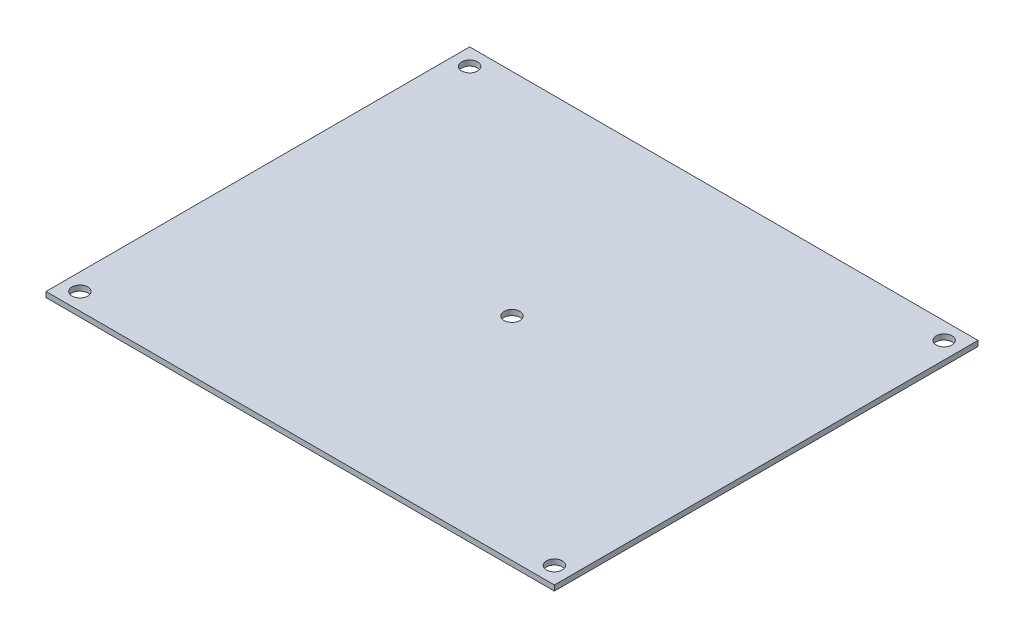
ISO-10303-21;
HEADER;
FILE_DESCRIPTION(('STEP AP214'),'2;1');
FILE_NAME('part.step','',(''),(''),'','','');
FILE_SCHEMA(('AUTOMOTIVE_DESIGN { 1 0 10303 214 1 1 1 1 }'));
ENDSEC;
DATA;
#1=APPLICATION_CONTEXT('core data for automotive mechanical design processes');
#2=APPLICATION_PROTOCOL_DEFINITION('international standard','automotive_design',2000,#1);
#3=PRODUCT_CONTEXT('',#1,'mechanical');
#4=PRODUCT('Part','Part','',(#3));
#5=PRODUCT_RELATED_PRODUCT_CATEGORY('part','',(#4));
#6=PRODUCT_DEFINITION_FORMATION('','',#4);
#7=PRODUCT_DEFINITION_CONTEXT('part definition',#1,'design');
#8=PRODUCT_DEFINITION('design','',#6,#7);
#9=PRODUCT_DEFINITION_SHAPE('','',#8);
#10=(LENGTH_UNIT() NAMED_UNIT(*) SI_UNIT(.MILLI.,.METRE.));
#11=(NAMED_UNIT(*) PLANE_ANGLE_UNIT() SI_UNIT($,.RADIAN.));
#12=(NAMED_UNIT(*) SI_UNIT($,.STERADIAN.) SOLID_ANGLE_UNIT());
#13=UNCERTAINTY_MEASURE_WITH_UNIT(LENGTH_MEASURE(1.E-05),#10,'distance_accuracy_value','');
#14=(GEOMETRIC_REPRESENTATION_CONTEXT(3) GLOBAL_UNCERTAINTY_ASSIGNED_CONTEXT((#13)) GLOBAL_UNIT_ASSIGNED_CONTEXT((#10,
#11,#12)) REPRESENTATION_CONTEXT('',''));
#15=CARTESIAN_POINT('',(0.,0.,0.));
#16=DIRECTION('',(0.,0.,1.));
#17=DIRECTION('',(1.,0.,0.));
#18=AXIS2_PLACEMENT_3D('',#15,#16,#17);
#19=CARTESIAN_POINT('',(-76.2,1.6002,-63.5));
#20=DIRECTION('',(1.,0.,0.));
#21=DIRECTION('',(0.,0.,-1.));
#22=AXIS2_PLACEMENT_3D('',#19,#20,#21);
#23=PLANE('',#22);
#24=DIRECTION('',(0.,0.,1.));
#25=VECTOR('',#24,1.);
#26=CARTESIAN_POINT('',(-76.2,0.,-63.5));
#27=LINE('',#26,#25);
#28=CARTESIAN_POINT('',(-76.2,0.,-63.5));
#29=VERTEX_POINT('',#28);
#30=CARTESIAN_POINT('',(-76.2,0.,63.5));
#31=VERTEX_POINT('',#30);
#32=EDGE_CURVE('E93',#29,#31,#27,.T.);
#33=ORIENTED_EDGE('',*,*,#32,.T.);
#34=DIRECTION('',(0.,-1.,0.));
#35=VECTOR('',#34,1.);
#36=CARTESIAN_POINT('',(-76.2,1.6002,63.5));
#37=LINE('',#36,#35);
#38=CARTESIAN_POINT('',(-76.2,1.6002,63.5));
#39=VERTEX_POINT('',#38);
#40=EDGE_CURVE('E11',#39,#31,#37,.T.);
#41=ORIENTED_EDGE('',*,*,#40,.F.);
#42=DIRECTION('',(0.,0.,1.));
#43=VECTOR('',#42,1.);
#44=CARTESIAN_POINT('',(-76.2,1.6002,-63.5));
#45=LINE('',#44,#43);
#46=CARTESIAN_POINT('',(-76.2,1.6002,-63.5));
#47=VERTEX_POINT('',#46);
#48=EDGE_CURVE('E81',#47,#39,#45,.T.);
#49=ORIENTED_EDGE('',*,*,#48,.F.);
#50=DIRECTION('',(0.,-1.,0.));
#51=VECTOR('',#50,1.);
#52=CARTESIAN_POINT('',(-76.2,1.6002,-63.5));
#53=LINE('',#52,#51);
#54=EDGE_CURVE('E89',#47,#29,#53,.T.);
#55=ORIENTED_EDGE('',*,*,#54,.T.);
#56=EDGE_LOOP('',(#33,#41,#49,#55));
#57=FACE_BOUND('',#56,.T.);
#58=ADVANCED_FACE('F30',(#57),#23,.F.);
#59=CARTESIAN_POINT('',(-76.2,1.6002,63.5));
#60=DIRECTION('',(0.,0.,-1.));
#61=DIRECTION('',(-1.,0.,0.));
#62=AXIS2_PLACEMENT_3D('',#59,#60,#61);
#63=PLANE('',#62);
#64=DIRECTION('',(1.,0.,0.));
#65=VECTOR('',#64,1.);
#66=CARTESIAN_POINT('',(-76.2,0.,63.5));
#67=LINE('',#66,#65);
#68=CARTESIAN_POINT('',(76.2,0.,63.5));
#69=VERTEX_POINT('',#68);
#70=EDGE_CURVE('E85',#31,#69,#67,.T.);
#71=ORIENTED_EDGE('',*,*,#70,.T.);
#72=DIRECTION('',(0.,-1.,0.));
#73=VECTOR('',#72,1.);
#74=CARTESIAN_POINT('',(76.2,1.6002,63.5));
#75=LINE('',#74,#73);
#76=CARTESIAN_POINT('',(76.2,1.6002,63.5));
#77=VERTEX_POINT('',#76);
#78=EDGE_CURVE('E38',#77,#69,#75,.T.);
#79=ORIENTED_EDGE('',*,*,#78,.F.);
#80=DIRECTION('',(1.,0.,0.));
#81=VECTOR('',#80,1.);
#82=CARTESIAN_POINT('',(-76.2,1.6002,63.5));
#83=LINE('',#82,#81);
#84=EDGE_CURVE('E76',#39,#77,#83,.T.);
#85=ORIENTED_EDGE('',*,*,#84,.F.);
#86=ORIENTED_EDGE('',*,*,#40,.T.);
#87=EDGE_LOOP('',(#71,#79,#85,#86));
#88=FACE_BOUND('',#87,.T.);
#89=ADVANCED_FACE('F84',(#88),#63,.F.);
#90=CARTESIAN_POINT('',(76.2,1.6002,-63.5));
#91=DIRECTION('',(-1.,0.,0.));
#92=DIRECTION('',(0.,0.,1.));
#93=AXIS2_PLACEMENT_3D('',#90,#91,#92);
#94=PLANE('',#93);
#95=DIRECTION('',(0.,0.,-1.));
#96=VECTOR('',#95,1.);
#97=CARTESIAN_POINT('',(76.2,0.,-63.5));
#98=LINE('',#97,#96);
#99=CARTESIAN_POINT('',(76.2,0.,-63.5));
#100=VERTEX_POINT('',#99);
#101=EDGE_CURVE('E63',#69,#100,#98,.T.);
#102=ORIENTED_EDGE('',*,*,#101,.T.);
#103=DIRECTION('',(0.,-1.,0.));
#104=VECTOR('',#103,1.);
#105=CARTESIAN_POINT('',(76.2,1.6002,-63.5));
#106=LINE('',#105,#104);
#107=CARTESIAN_POINT('',(76.2,1.6002,-63.5));
#108=VERTEX_POINT('',#107);
#109=EDGE_CURVE('E86',#108,#100,#106,.T.);
#110=ORIENTED_EDGE('',*,*,#109,.F.);
#111=DIRECTION('',(0.,0.,-1.));
#112=VECTOR('',#111,1.);
#113=CARTESIAN_POINT('',(76.2,1.6002,-63.5));
#114=LINE('',#113,#112);
#115=EDGE_CURVE('E79',#77,#108,#114,.T.);
#116=ORIENTED_EDGE('',*,*,#115,.F.);
#117=ORIENTED_EDGE('',*,*,#78,.T.);
#118=EDGE_LOOP('',(#102,#110,#116,#117));
#119=FACE_BOUND('',#118,.T.);
#120=ADVANCED_FACE('F87',(#119),#94,.F.);
#121=CARTESIAN_POINT('',(-76.2,1.6002,-63.5));
#122=DIRECTION('',(0.,0.,1.));
#123=DIRECTION('',(1.,0.,0.));
#124=AXIS2_PLACEMENT_3D('',#121,#122,#123);
#125=PLANE('',#124);
#126=DIRECTION('',(-1.,0.,0.));
#127=VECTOR('',#126,1.);
#128=CARTESIAN_POINT('',(-76.2,0.,-63.5));
#129=LINE('',#128,#127);
#130=EDGE_CURVE('E69',#100,#29,#129,.T.);
#131=ORIENTED_EDGE('',*,*,#130,.T.);
#132=ORIENTED_EDGE('',*,*,#54,.F.);
#133=DIRECTION('',(-1.,0.,0.));
#134=VECTOR('',#133,1.);
#135=CARTESIAN_POINT('',(-76.2,1.6002,-63.5));
#136=LINE('',#135,#134);
#137=EDGE_CURVE('E46',#108,#47,#136,.T.);
#138=ORIENTED_EDGE('',*,*,#137,.F.);
#139=ORIENTED_EDGE('',*,*,#109,.T.);
#140=EDGE_LOOP('',(#131,#132,#138,#139));
#141=FACE_BOUND('',#140,.T.);
#142=ADVANCED_FACE('F101',(#141),#125,.F.);
#143=CARTESIAN_POINT('',(-76.2,1.6002,63.5));
#144=DIRECTION('',(0.,1.,0.));
#145=DIRECTION('',(0.,0.,1.));
#146=AXIS2_PLACEMENT_3D('',#143,#144,#145);
#147=PLANE('',#146);
#148=CARTESIAN_POINT('',(0.,1.6002,0.));
#149=DIRECTION('',(0.,1.,0.));
#150=DIRECTION('',(0.,0.,1.));
#151=AXIS2_PLACEMENT_3D('',#148,#149,#150);
#152=CIRCLE('',#151,2.3749);
#153=CARTESIAN_POINT('',(0.,1.6002,2.3749));
#154=VERTEX_POINT('',#153);
#155=EDGE_CURVE('E131',#154,#154,#152,.T.);
#156=ORIENTED_EDGE('',*,*,#155,.F.);
#157=EDGE_LOOP('',(#156));
#158=FACE_BOUND('',#157,.T.);
#159=CARTESIAN_POINT('',(71.12,1.6002,58.42));
#160=DIRECTION('',(0.,1.,0.));
#161=DIRECTION('',(0.,0.,1.));
#162=AXIS2_PLACEMENT_3D('',#159,#160,#161);
#163=CIRCLE('',#162,2.3749);
#164=CARTESIAN_POINT('',(71.12,1.6002,60.7949));
#165=VERTEX_POINT('',#164);
#166=EDGE_CURVE('E125',#165,#165,#163,.T.);
#167=ORIENTED_EDGE('',*,*,#166,.F.);
#168=EDGE_LOOP('',(#167));
#169=FACE_BOUND('',#168,.T.);
#170=CARTESIAN_POINT('',(-71.12,1.6002,58.42));
#171=DIRECTION('',(0.,1.,0.));
#172=DIRECTION('',(0.,0.,1.));
#173=AXIS2_PLACEMENT_3D('',#170,#171,#172);
#174=CIRCLE('',#173,2.3749);
#175=CARTESIAN_POINT('',(-71.12,1.6002,60.7949));
#176=VERTEX_POINT('',#175);
#177=EDGE_CURVE('E119',#176,#176,#174,.T.);
#178=ORIENTED_EDGE('',*,*,#177,.F.);
#179=EDGE_LOOP('',(#178));
#180=FACE_BOUND('',#179,.T.);
#181=CARTESIAN_POINT('',(-71.12,1.6002,-58.42));
#182=DIRECTION('',(0.,1.,0.));
#183=DIRECTION('',(0.,0.,1.));
#184=AXIS2_PLACEMENT_3D('',#181,#182,#183);
#185=CIRCLE('',#184,2.3749);
#186=CARTESIAN_POINT('',(-71.12,1.6002,-56.0451));
#187=VERTEX_POINT('',#186);
#188=EDGE_CURVE('E113',#187,#187,#185,.T.);
#189=ORIENTED_EDGE('',*,*,#188,.F.);
#190=EDGE_LOOP('',(#189));
#191=FACE_BOUND('',#190,.T.);
#192=CARTESIAN_POINT('',(71.12,1.6002,-58.42));
#193=DIRECTION('',(0.,1.,0.));
#194=DIRECTION('',(0.,0.,1.));
#195=AXIS2_PLACEMENT_3D('',#192,#193,#194);
#196=CIRCLE('',#195,2.3749);
#197=CARTESIAN_POINT('',(71.12,1.6002,-56.0451));
#198=VERTEX_POINT('',#197);
#199=EDGE_CURVE('E107',#198,#198,#196,.T.);
#200=ORIENTED_EDGE('',*,*,#199,.F.);
#201=EDGE_LOOP('',(#200));
#202=FACE_BOUND('',#201,.T.);
#203=ORIENTED_EDGE('',*,*,#48,.T.);
#204=ORIENTED_EDGE('',*,*,#84,.T.);
#205=ORIENTED_EDGE('',*,*,#115,.T.);
#206=ORIENTED_EDGE('',*,*,#137,.T.);
#207=EDGE_LOOP('',(#203,#204,#205,#206));
#208=FACE_BOUND('',#207,.T.);
#209=ADVANCED_FACE('F77',(#158,#169,#180,#191,#202,#208),#147,.T.);
#210=CARTESIAN_POINT('',(-76.2,0.,63.5));
#211=DIRECTION('',(0.,1.,0.));
#212=DIRECTION('',(0.,0.,1.));
#213=AXIS2_PLACEMENT_3D('',#210,#211,#212);
#214=PLANE('',#213);
#215=CARTESIAN_POINT('',(0.,0.,0.));
#216=DIRECTION('',(0.,1.,0.));
#217=DIRECTION('',(0.,0.,1.));
#218=AXIS2_PLACEMENT_3D('',#215,#216,#217);
#219=CIRCLE('',#218,2.3749);
#220=CARTESIAN_POINT('',(0.,0.,2.3749));
#221=VERTEX_POINT('',#220);
#222=EDGE_CURVE('E128',#221,#221,#219,.T.);
#223=ORIENTED_EDGE('',*,*,#222,.T.);
#224=EDGE_LOOP('',(#223));
#225=FACE_BOUND('',#224,.T.);
#226=CARTESIAN_POINT('',(71.12,0.,58.42));
#227=DIRECTION('',(0.,1.,0.));
#228=DIRECTION('',(0.,0.,1.));
#229=AXIS2_PLACEMENT_3D('',#226,#227,#228);
#230=CIRCLE('',#229,2.3749);
#231=CARTESIAN_POINT('',(71.12,0.,60.7949));
#232=VERTEX_POINT('',#231);
#233=EDGE_CURVE('E122',#232,#232,#230,.T.);
#234=ORIENTED_EDGE('',*,*,#233,.T.);
#235=EDGE_LOOP('',(#234));
#236=FACE_BOUND('',#235,.T.);
#237=CARTESIAN_POINT('',(-71.12,0.,58.42));
#238=DIRECTION('',(0.,1.,0.));
#239=DIRECTION('',(0.,0.,1.));
#240=AXIS2_PLACEMENT_3D('',#237,#238,#239);
#241=CIRCLE('',#240,2.3749);
#242=CARTESIAN_POINT('',(-71.12,0.,60.7949));
#243=VERTEX_POINT('',#242);
#244=EDGE_CURVE('E116',#243,#243,#241,.T.);
#245=ORIENTED_EDGE('',*,*,#244,.T.);
#246=EDGE_LOOP('',(#245));
#247=FACE_BOUND('',#246,.T.);
#248=CARTESIAN_POINT('',(-71.12,0.,-58.42));
#249=DIRECTION('',(0.,1.,0.));
#250=DIRECTION('',(0.,0.,1.));
#251=AXIS2_PLACEMENT_3D('',#248,#249,#250);
#252=CIRCLE('',#251,2.3749);
#253=CARTESIAN_POINT('',(-71.12,0.,-56.0451));
#254=VERTEX_POINT('',#253);
#255=EDGE_CURVE('E110',#254,#254,#252,.T.);
#256=ORIENTED_EDGE('',*,*,#255,.T.);
#257=EDGE_LOOP('',(#256));
#258=FACE_BOUND('',#257,.T.);
#259=CARTESIAN_POINT('',(71.12,0.,-58.42));
#260=DIRECTION('',(0.,1.,0.));
#261=DIRECTION('',(0.,0.,1.));
#262=AXIS2_PLACEMENT_3D('',#259,#260,#261);
#263=CIRCLE('',#262,2.3749);
#264=CARTESIAN_POINT('',(71.12,0.,-56.0451));
#265=VERTEX_POINT('',#264);
#266=EDGE_CURVE('E96',#265,#265,#263,.T.);
#267=ORIENTED_EDGE('',*,*,#266,.T.);
#268=EDGE_LOOP('',(#267));
#269=FACE_BOUND('',#268,.T.);
#270=ORIENTED_EDGE('',*,*,#32,.F.);
#271=ORIENTED_EDGE('',*,*,#130,.F.);
#272=ORIENTED_EDGE('',*,*,#101,.F.);
#273=ORIENTED_EDGE('',*,*,#70,.F.);
#274=EDGE_LOOP('',(#270,#271,#272,#273));
#275=FACE_BOUND('',#274,.T.);
#276=ADVANCED_FACE('F104',(#225,#236,#247,#258,#269,#275),#214,.F.);
#277=CARTESIAN_POINT('',(71.12,0.,-58.42));
#278=DIRECTION('',(0.,1.,0.));
#279=DIRECTION('',(0.,0.,1.));
#280=AXIS2_PLACEMENT_3D('',#277,#278,#279);
#281=CYLINDRICAL_SURFACE('',#280,2.3749);
#282=ORIENTED_EDGE('',*,*,#266,.F.);
#283=EDGE_LOOP('',(#282));
#284=FACE_BOUND('',#283,.T.);
#285=ORIENTED_EDGE('',*,*,#199,.T.);
#286=EDGE_LOOP('',(#285));
#287=FACE_BOUND('',#286,.T.);
#288=ADVANCED_FACE('F157',(#284,#287),#281,.F.);
#289=CARTESIAN_POINT('',(-71.12,0.,-58.42));
#290=DIRECTION('',(0.,1.,0.));
#291=DIRECTION('',(0.,0.,1.));
#292=AXIS2_PLACEMENT_3D('',#289,#290,#291);
#293=CYLINDRICAL_SURFACE('',#292,2.3749);
#294=ORIENTED_EDGE('',*,*,#255,.F.);
#295=EDGE_LOOP('',(#294));
#296=FACE_BOUND('',#295,.T.);
#297=ORIENTED_EDGE('',*,*,#188,.T.);
#298=EDGE_LOOP('',(#297));
#299=FACE_BOUND('',#298,.T.);
#300=ADVANCED_FACE('F159',(#296,#299),#293,.F.);
#301=CARTESIAN_POINT('',(-71.12,0.,58.42));
#302=DIRECTION('',(0.,1.,0.));
#303=DIRECTION('',(0.,0.,1.));
#304=AXIS2_PLACEMENT_3D('',#301,#302,#303);
#305=CYLINDRICAL_SURFACE('',#304,2.3749);
#306=ORIENTED_EDGE('',*,*,#244,.F.);
#307=EDGE_LOOP('',(#306));
#308=FACE_BOUND('',#307,.T.);
#309=ORIENTED_EDGE('',*,*,#177,.T.);
#310=EDGE_LOOP('',(#309));
#311=FACE_BOUND('',#310,.T.);
#312=ADVANCED_FACE('F166',(#308,#311),#305,.F.);
#313=CARTESIAN_POINT('',(71.12,0.,58.42));
#314=DIRECTION('',(0.,1.,0.));
#315=DIRECTION('',(0.,0.,1.));
#316=AXIS2_PLACEMENT_3D('',#313,#314,#315);
#317=CYLINDRICAL_SURFACE('',#316,2.3749);
#318=ORIENTED_EDGE('',*,*,#233,.F.);
#319=EDGE_LOOP('',(#318));
#320=FACE_BOUND('',#319,.T.);
#321=ORIENTED_EDGE('',*,*,#166,.T.);
#322=EDGE_LOOP('',(#321));
#323=FACE_BOUND('',#322,.T.);
#324=ADVANCED_FACE('F142',(#320,#323),#317,.F.);
#325=CARTESIAN_POINT('',(0.,0.,0.));
#326=DIRECTION('',(0.,1.,0.));
#327=DIRECTION('',(0.,0.,1.));
#328=AXIS2_PLACEMENT_3D('',#325,#326,#327);
#329=CYLINDRICAL_SURFACE('',#328,2.3749);
#330=ORIENTED_EDGE('',*,*,#222,.F.);
#331=EDGE_LOOP('',(#330));
#332=FACE_BOUND('',#331,.T.);
#333=ORIENTED_EDGE('',*,*,#155,.T.);
#334=EDGE_LOOP('',(#333));
#335=FACE_BOUND('',#334,.T.);
#336=ADVANCED_FACE('F139',(#332,#335),#329,.F.);
#337=CLOSED_SHELL('',(#58,#89,#120,#142,#209,#276,#288,#300,#312,#324,#336));
#338=MANIFOLD_SOLID_BREP('B2',#337);
#339=ADVANCED_BREP_SHAPE_REPRESENTATION('',(#18,#338),#14);
#340=SHAPE_DEFINITION_REPRESENTATION(#9,#339);
ENDSEC;
END-ISO-10303-21;
